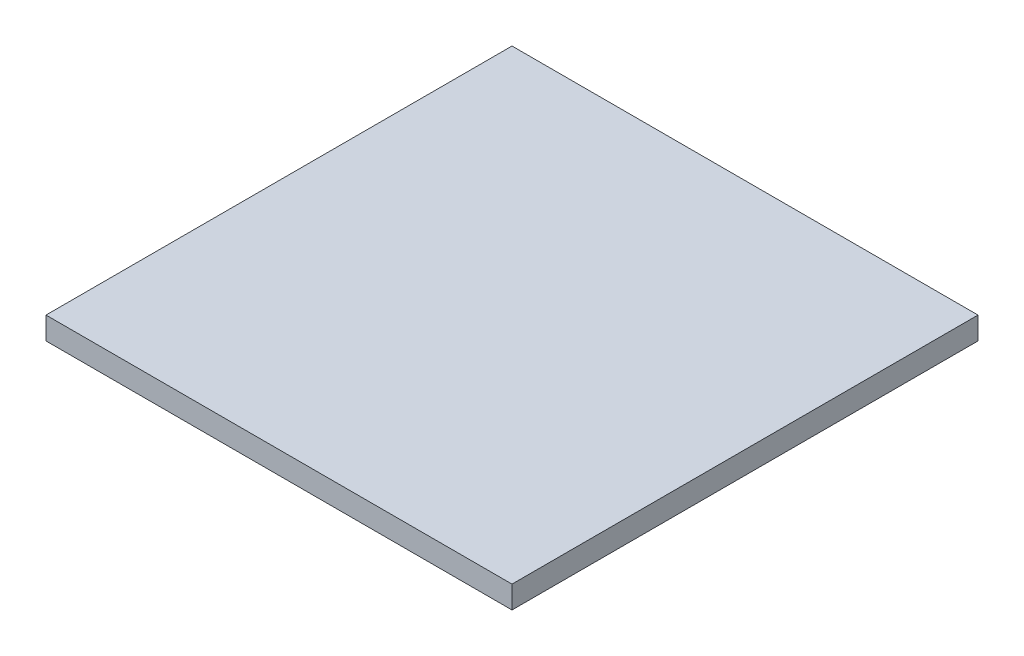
ISO-10303-21;
HEADER;
FILE_DESCRIPTION(('STEP AP214'),'2;1');
FILE_NAME('part.step','',(''),(''),'','','');
FILE_SCHEMA(('AUTOMOTIVE_DESIGN { 1 0 10303 214 1 1 1 1 }'));
ENDSEC;
DATA;
#1=APPLICATION_CONTEXT('core data for automotive mechanical design processes');
#2=APPLICATION_PROTOCOL_DEFINITION('international standard','automotive_design',2000,#1);
#3=PRODUCT_CONTEXT('',#1,'mechanical');
#4=PRODUCT('Part','Part','',(#3));
#5=PRODUCT_RELATED_PRODUCT_CATEGORY('part','',(#4));
#6=PRODUCT_DEFINITION_FORMATION('','',#4);
#7=PRODUCT_DEFINITION_CONTEXT('part definition',#1,'design');
#8=PRODUCT_DEFINITION('design','',#6,#7);
#9=PRODUCT_DEFINITION_SHAPE('','',#8);
#10=(LENGTH_UNIT() NAMED_UNIT(*) SI_UNIT(.MILLI.,.METRE.));
#11=(NAMED_UNIT(*) PLANE_ANGLE_UNIT() SI_UNIT($,.RADIAN.));
#12=(NAMED_UNIT(*) SI_UNIT($,.STERADIAN.) SOLID_ANGLE_UNIT());
#13=UNCERTAINTY_MEASURE_WITH_UNIT(LENGTH_MEASURE(1.E-05),#10,'distance_accuracy_value','');
#14=(GEOMETRIC_REPRESENTATION_CONTEXT(3) GLOBAL_UNCERTAINTY_ASSIGNED_CONTEXT((#13)) GLOBAL_UNIT_ASSIGNED_CONTEXT((#10,
#11,#12)) REPRESENTATION_CONTEXT('',''));
#15=CARTESIAN_POINT('',(0.,0.,0.));
#16=DIRECTION('',(0.,0.,1.));
#17=DIRECTION('',(1.,0.,0.));
#18=AXIS2_PLACEMENT_3D('',#15,#16,#17);
#19=CARTESIAN_POINT('',(-13.5,1.3,13.5));
#20=DIRECTION('',(-1.,0.,0.));
#21=DIRECTION('',(0.,0.,1.));
#22=AXIS2_PLACEMENT_3D('',#19,#20,#21);
#23=PLANE('',#22);
#24=DIRECTION('',(0.,0.,-1.));
#25=VECTOR('',#24,1.);
#26=CARTESIAN_POINT('',(-13.5,0.,13.5));
#27=LINE('',#26,#25);
#28=CARTESIAN_POINT('',(-13.5,0.,13.5));
#29=VERTEX_POINT('',#28);
#30=CARTESIAN_POINT('',(-13.5,0.,-13.5));
#31=VERTEX_POINT('',#30);
#32=EDGE_CURVE('E98',#29,#31,#27,.T.);
#33=ORIENTED_EDGE('',*,*,#32,.F.);
#34=DIRECTION('',(0.,-1.,0.));
#35=VECTOR('',#34,1.);
#36=CARTESIAN_POINT('',(-13.5,1.3,13.5));
#37=LINE('',#36,#35);
#38=CARTESIAN_POINT('',(-13.5,1.3,13.5));
#39=VERTEX_POINT('',#38);
#40=EDGE_CURVE('E11',#39,#29,#37,.T.);
#41=ORIENTED_EDGE('',*,*,#40,.F.);
#42=DIRECTION('',(0.,0.,-1.));
#43=VECTOR('',#42,1.);
#44=CARTESIAN_POINT('',(-13.5,1.3,13.5));
#45=LINE('',#44,#43);
#46=CARTESIAN_POINT('',(-13.5,1.3,-13.5));
#47=VERTEX_POINT('',#46);
#48=EDGE_CURVE('E93',#39,#47,#45,.T.);
#49=ORIENTED_EDGE('',*,*,#48,.T.);
#50=DIRECTION('',(0.,-1.,0.));
#51=VECTOR('',#50,1.);
#52=CARTESIAN_POINT('',(-13.5,1.3,-13.5));
#53=LINE('',#52,#51);
#54=EDGE_CURVE('E36',#47,#31,#53,.T.);
#55=ORIENTED_EDGE('',*,*,#54,.T.);
#56=EDGE_LOOP('',(#33,#41,#49,#55));
#57=FACE_BOUND('',#56,.T.);
#58=ADVANCED_FACE('F33',(#57),#23,.T.);
#59=CARTESIAN_POINT('',(-13.5,1.3,13.5));
#60=DIRECTION('',(0.,0.,-1.));
#61=DIRECTION('',(-1.,0.,0.));
#62=AXIS2_PLACEMENT_3D('',#59,#60,#61);
#63=PLANE('',#62);
#64=DIRECTION('',(1.,0.,0.));
#65=VECTOR('',#64,1.);
#66=CARTESIAN_POINT('',(-13.5,0.,13.5));
#67=LINE('',#66,#65);
#68=CARTESIAN_POINT('',(13.5,0.,13.5));
#69=VERTEX_POINT('',#68);
#70=EDGE_CURVE('E66',#29,#69,#67,.T.);
#71=ORIENTED_EDGE('',*,*,#70,.T.);
#72=DIRECTION('',(0.,-1.,0.));
#73=VECTOR('',#72,1.);
#74=CARTESIAN_POINT('',(13.5,1.3,13.5));
#75=LINE('',#74,#73);
#76=CARTESIAN_POINT('',(13.5,1.3,13.5));
#77=VERTEX_POINT('',#76);
#78=EDGE_CURVE('E42',#77,#69,#75,.T.);
#79=ORIENTED_EDGE('',*,*,#78,.F.);
#80=DIRECTION('',(1.,0.,0.));
#81=VECTOR('',#80,1.);
#82=CARTESIAN_POINT('',(-13.5,1.3,13.5));
#83=LINE('',#82,#81);
#84=EDGE_CURVE('E83',#39,#77,#83,.T.);
#85=ORIENTED_EDGE('',*,*,#84,.F.);
#86=ORIENTED_EDGE('',*,*,#40,.T.);
#87=EDGE_LOOP('',(#71,#79,#85,#86));
#88=FACE_BOUND('',#87,.T.);
#89=ADVANCED_FACE('F108',(#88),#63,.F.);
#90=CARTESIAN_POINT('',(13.5,1.3,13.5));
#91=DIRECTION('',(-1.,0.,0.));
#92=DIRECTION('',(0.,0.,1.));
#93=AXIS2_PLACEMENT_3D('',#90,#91,#92);
#94=PLANE('',#93);
#95=DIRECTION('',(0.,0.,-1.));
#96=VECTOR('',#95,1.);
#97=CARTESIAN_POINT('',(13.5,0.,13.5));
#98=LINE('',#97,#96);
#99=CARTESIAN_POINT('',(13.5,0.,-13.5));
#100=VERTEX_POINT('',#99);
#101=EDGE_CURVE('E90',#69,#100,#98,.T.);
#102=ORIENTED_EDGE('',*,*,#101,.T.);
#103=DIRECTION('',(0.,-1.,0.));
#104=VECTOR('',#103,1.);
#105=CARTESIAN_POINT('',(13.5,1.3,-13.5));
#106=LINE('',#105,#104);
#107=CARTESIAN_POINT('',(13.5,1.3,-13.5));
#108=VERTEX_POINT('',#107);
#109=EDGE_CURVE('E87',#108,#100,#106,.T.);
#110=ORIENTED_EDGE('',*,*,#109,.F.);
#111=DIRECTION('',(0.,0.,-1.));
#112=VECTOR('',#111,1.);
#113=CARTESIAN_POINT('',(13.5,1.3,13.5));
#114=LINE('',#113,#112);
#115=EDGE_CURVE('E78',#77,#108,#114,.T.);
#116=ORIENTED_EDGE('',*,*,#115,.F.);
#117=ORIENTED_EDGE('',*,*,#78,.T.);
#118=EDGE_LOOP('',(#102,#110,#116,#117));
#119=FACE_BOUND('',#118,.T.);
#120=ADVANCED_FACE('F88',(#119),#94,.F.);
#121=CARTESIAN_POINT('',(-13.5,1.3,-13.5));
#122=DIRECTION('',(0.,0.,-1.));
#123=DIRECTION('',(-1.,0.,0.));
#124=AXIS2_PLACEMENT_3D('',#121,#122,#123);
#125=PLANE('',#124);
#126=DIRECTION('',(1.,0.,0.));
#127=VECTOR('',#126,1.);
#128=CARTESIAN_POINT('',(-13.5,0.,-13.5));
#129=LINE('',#128,#127);
#130=EDGE_CURVE('E101',#31,#100,#129,.T.);
#131=ORIENTED_EDGE('',*,*,#130,.F.);
#132=ORIENTED_EDGE('',*,*,#54,.F.);
#133=DIRECTION('',(1.,0.,0.));
#134=VECTOR('',#133,1.);
#135=CARTESIAN_POINT('',(-13.5,1.3,-13.5));
#136=LINE('',#135,#134);
#137=EDGE_CURVE('E82',#47,#108,#136,.T.);
#138=ORIENTED_EDGE('',*,*,#137,.T.);
#139=ORIENTED_EDGE('',*,*,#109,.T.);
#140=EDGE_LOOP('',(#131,#132,#138,#139));
#141=FACE_BOUND('',#140,.T.);
#142=ADVANCED_FACE('F92',(#141),#125,.T.);
#143=CARTESIAN_POINT('',(0.,1.3,0.));
#144=DIRECTION('',(0.,-1.,0.));
#145=DIRECTION('',(0.,0.,-1.));
#146=AXIS2_PLACEMENT_3D('',#143,#144,#145);
#147=PLANE('',#146);
#148=ORIENTED_EDGE('',*,*,#48,.F.);
#149=ORIENTED_EDGE('',*,*,#84,.T.);
#150=ORIENTED_EDGE('',*,*,#115,.T.);
#151=ORIENTED_EDGE('',*,*,#137,.F.);
#152=EDGE_LOOP('',(#148,#149,#150,#151));
#153=FACE_BOUND('',#152,.T.);
#154=ADVANCED_FACE('F81',(#153),#147,.F.);
#155=CARTESIAN_POINT('',(0.,0.,0.));
#156=DIRECTION('',(0.,-1.,0.));
#157=DIRECTION('',(0.,0.,-1.));
#158=AXIS2_PLACEMENT_3D('',#155,#156,#157);
#159=PLANE('',#158);
#160=ORIENTED_EDGE('',*,*,#32,.T.);
#161=ORIENTED_EDGE('',*,*,#130,.T.);
#162=ORIENTED_EDGE('',*,*,#101,.F.);
#163=ORIENTED_EDGE('',*,*,#70,.F.);
#164=EDGE_LOOP('',(#160,#161,#162,#163));
#165=FACE_BOUND('',#164,.T.);
#166=ADVANCED_FACE('F106',(#165),#159,.T.);
#167=CLOSED_SHELL('',(#58,#89,#120,#142,#154,#166));
#168=MANIFOLD_SOLID_BREP('B2',#167);
#169=ADVANCED_BREP_SHAPE_REPRESENTATION('',(#18,#168),#14);
#170=SHAPE_DEFINITION_REPRESENTATION(#9,#169);
ENDSEC;
END-ISO-10303-21;
